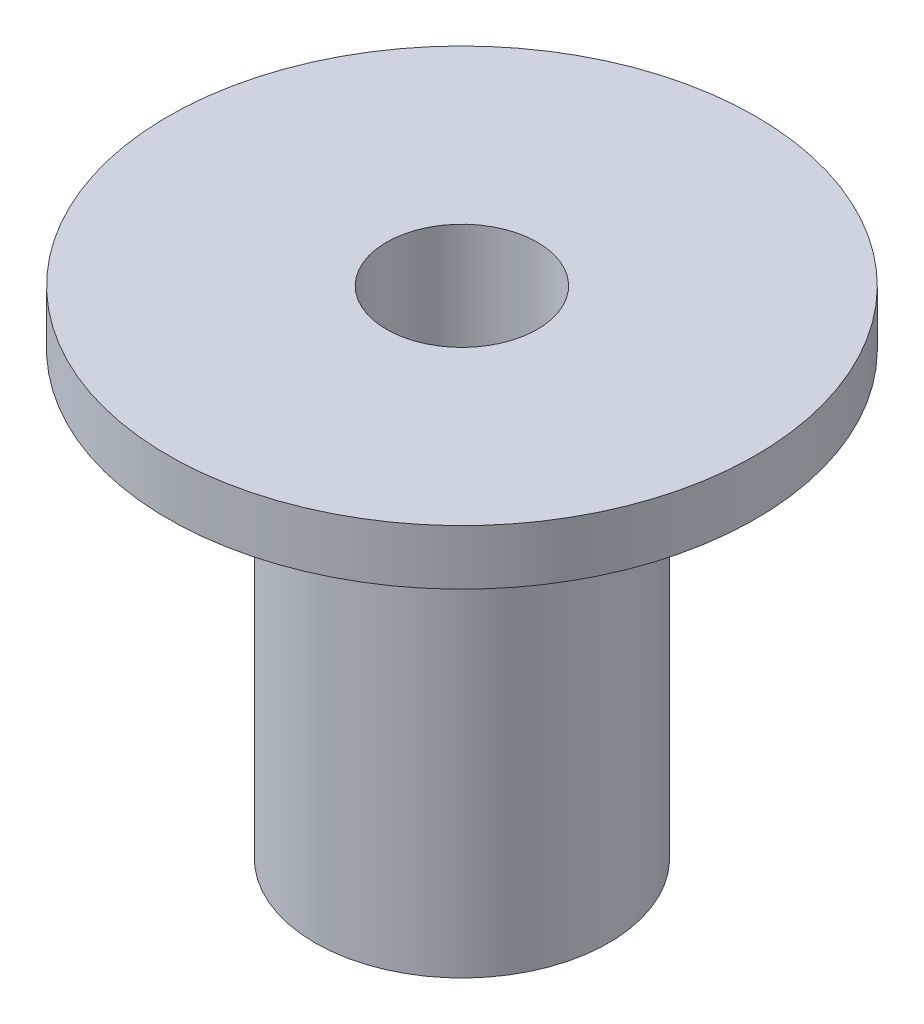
ISO-10303-21;
HEADER;
FILE_DESCRIPTION(('STEP AP214'),'2;1');
FILE_NAME('part.step','',(''),(''),'','','');
FILE_SCHEMA(('AUTOMOTIVE_DESIGN { 1 0 10303 214 1 1 1 1 }'));
ENDSEC;
DATA;
#1=APPLICATION_CONTEXT('core data for automotive mechanical design processes');
#2=APPLICATION_PROTOCOL_DEFINITION('international standard','automotive_design',2000,#1);
#3=PRODUCT_CONTEXT('',#1,'mechanical');
#4=PRODUCT('Part','Part','',(#3));
#5=PRODUCT_RELATED_PRODUCT_CATEGORY('part','',(#4));
#6=PRODUCT_DEFINITION_FORMATION('','',#4);
#7=PRODUCT_DEFINITION_CONTEXT('part definition',#1,'design');
#8=PRODUCT_DEFINITION('design','',#6,#7);
#9=PRODUCT_DEFINITION_SHAPE('','',#8);
#10=(LENGTH_UNIT() NAMED_UNIT(*) SI_UNIT(.MILLI.,.METRE.));
#11=(NAMED_UNIT(*) PLANE_ANGLE_UNIT() SI_UNIT($,.RADIAN.));
#12=(NAMED_UNIT(*) SI_UNIT($,.STERADIAN.) SOLID_ANGLE_UNIT());
#13=UNCERTAINTY_MEASURE_WITH_UNIT(LENGTH_MEASURE(1.E-05),#10,'distance_accuracy_value','');
#14=(GEOMETRIC_REPRESENTATION_CONTEXT(3) GLOBAL_UNCERTAINTY_ASSIGNED_CONTEXT((#13)) GLOBAL_UNIT_ASSIGNED_CONTEXT((#10,
#11,#12)) REPRESENTATION_CONTEXT('',''));
#15=CARTESIAN_POINT('',(0.,0.,0.));
#16=DIRECTION('',(0.,0.,1.));
#17=DIRECTION('',(1.,0.,0.));
#18=AXIS2_PLACEMENT_3D('',#15,#16,#17);
#19=CARTESIAN_POINT('',(6.35,0.,0.));
#20=DIRECTION('',(0.,-1.,0.));
#21=DIRECTION('',(0.,0.,-1.));
#22=AXIS2_PLACEMENT_3D('',#19,#20,#21);
#23=PLANE('',#22);
#24=CARTESIAN_POINT('',(0.,0.,0.));
#25=DIRECTION('',(0.,-1.,0.));
#26=DIRECTION('',(0.,0.,-1.));
#27=AXIS2_PLACEMENT_3D('',#24,#25,#26);
#28=CIRCLE('',#27,6.35);
#29=CARTESIAN_POINT('',(0.,0.,-6.35));
#30=VERTEX_POINT('',#29);
#31=EDGE_CURVE('E62',#30,#30,#28,.T.);
#32=ORIENTED_EDGE('',*,*,#31,.T.);
#33=EDGE_LOOP('',(#32));
#34=FACE_BOUND('',#33,.T.);
#35=CARTESIAN_POINT('',(0.,0.,0.));
#36=DIRECTION('',(0.,-1.,0.));
#37=DIRECTION('',(0.,0.,-1.));
#38=AXIS2_PLACEMENT_3D('',#35,#36,#37);
#39=CIRCLE('',#38,3.2639);
#40=CARTESIAN_POINT('',(0.,0.,-3.2639));
#41=VERTEX_POINT('',#40);
#42=EDGE_CURVE('E10',#41,#41,#39,.T.);
#43=ORIENTED_EDGE('',*,*,#42,.F.);
#44=EDGE_LOOP('',(#43));
#45=FACE_BOUND('',#44,.T.);
#46=ADVANCED_FACE('F34',(#34,#45),#23,.T.);
#47=CARTESIAN_POINT('',(0.,0.,0.));
#48=DIRECTION('',(0.,-1.,0.));
#49=DIRECTION('',(0.,0.,-1.));
#50=AXIS2_PLACEMENT_3D('',#47,#48,#49);
#51=CYLINDRICAL_SURFACE('',#50,3.2639);
#52=ORIENTED_EDGE('',*,*,#42,.T.);
#53=EDGE_LOOP('',(#52));
#54=FACE_BOUND('',#53,.T.);
#55=CARTESIAN_POINT('',(0.,21.43125,0.));
#56=DIRECTION('',(0.,-1.,0.));
#57=DIRECTION('',(0.,0.,-1.));
#58=AXIS2_PLACEMENT_3D('',#55,#56,#57);
#59=CIRCLE('',#58,3.2639);
#60=CARTESIAN_POINT('',(0.,21.43125,-3.2639));
#61=VERTEX_POINT('',#60);
#62=EDGE_CURVE('E41',#61,#61,#59,.T.);
#63=ORIENTED_EDGE('',*,*,#62,.F.);
#64=EDGE_LOOP('',(#63));
#65=FACE_BOUND('',#64,.T.);
#66=ADVANCED_FACE('F80',(#54,#65),#51,.F.);
#67=CARTESIAN_POINT('',(3.2639,21.43125,0.));
#68=DIRECTION('',(0.,1.,0.));
#69=DIRECTION('',(0.,0.,1.));
#70=AXIS2_PLACEMENT_3D('',#67,#68,#69);
#71=PLANE('',#70);
#72=ORIENTED_EDGE('',*,*,#62,.T.);
#73=EDGE_LOOP('',(#72));
#74=FACE_BOUND('',#73,.T.);
#75=CARTESIAN_POINT('',(0.,21.43125,0.));
#76=DIRECTION('',(0.,-1.,0.));
#77=DIRECTION('',(0.,0.,-1.));
#78=AXIS2_PLACEMENT_3D('',#75,#76,#77);
#79=CIRCLE('',#78,12.7);
#80=CARTESIAN_POINT('',(0.,21.43125,-12.7));
#81=VERTEX_POINT('',#80);
#82=EDGE_CURVE('E48',#81,#81,#79,.T.);
#83=ORIENTED_EDGE('',*,*,#82,.F.);
#84=EDGE_LOOP('',(#83));
#85=FACE_BOUND('',#84,.T.);
#86=ADVANCED_FACE('F84',(#74,#85),#71,.T.);
#87=CARTESIAN_POINT('',(0.,0.,0.));
#88=DIRECTION('',(0.,-1.,0.));
#89=DIRECTION('',(0.,0.,-1.));
#90=AXIS2_PLACEMENT_3D('',#87,#88,#89);
#91=CYLINDRICAL_SURFACE('',#90,12.7);
#92=ORIENTED_EDGE('',*,*,#82,.T.);
#93=EDGE_LOOP('',(#92));
#94=FACE_BOUND('',#93,.T.);
#95=CARTESIAN_POINT('',(0.,19.05,0.));
#96=DIRECTION('',(0.,-1.,0.));
#97=DIRECTION('',(0.,0.,-1.));
#98=AXIS2_PLACEMENT_3D('',#95,#96,#97);
#99=CIRCLE('',#98,12.7);
#100=CARTESIAN_POINT('',(0.,19.05,-12.7));
#101=VERTEX_POINT('',#100);
#102=EDGE_CURVE('E53',#101,#101,#99,.T.);
#103=ORIENTED_EDGE('',*,*,#102,.F.);
#104=EDGE_LOOP('',(#103));
#105=FACE_BOUND('',#104,.T.);
#106=ADVANCED_FACE('F76',(#94,#105),#91,.T.);
#107=CARTESIAN_POINT('',(12.7,19.05,0.));
#108=DIRECTION('',(0.,-1.,0.));
#109=DIRECTION('',(0.,0.,-1.));
#110=AXIS2_PLACEMENT_3D('',#107,#108,#109);
#111=PLANE('',#110);
#112=ORIENTED_EDGE('',*,*,#102,.T.);
#113=EDGE_LOOP('',(#112));
#114=FACE_BOUND('',#113,.T.);
#115=CARTESIAN_POINT('',(0.,19.05,0.));
#116=DIRECTION('',(0.,-1.,0.));
#117=DIRECTION('',(0.,0.,-1.));
#118=AXIS2_PLACEMENT_3D('',#115,#116,#117);
#119=CIRCLE('',#118,6.35);
#120=CARTESIAN_POINT('',(0.,19.05,-6.35));
#121=VERTEX_POINT('',#120);
#122=EDGE_CURVE('E58',#121,#121,#119,.T.);
#123=ORIENTED_EDGE('',*,*,#122,.F.);
#124=EDGE_LOOP('',(#123));
#125=FACE_BOUND('',#124,.T.);
#126=ADVANCED_FACE('F70',(#114,#125),#111,.T.);
#127=CARTESIAN_POINT('',(0.,0.,0.));
#128=DIRECTION('',(0.,-1.,0.));
#129=DIRECTION('',(0.,0.,-1.));
#130=AXIS2_PLACEMENT_3D('',#127,#128,#129);
#131=CYLINDRICAL_SURFACE('',#130,6.35);
#132=ORIENTED_EDGE('',*,*,#122,.T.);
#133=EDGE_LOOP('',(#132));
#134=FACE_BOUND('',#133,.T.);
#135=ORIENTED_EDGE('',*,*,#31,.F.);
#136=EDGE_LOOP('',(#135));
#137=FACE_BOUND('',#136,.T.);
#138=ADVANCED_FACE('F68',(#134,#137),#131,.T.);
#139=CLOSED_SHELL('',(#46,#66,#86,#106,#126,#138));
#140=MANIFOLD_SOLID_BREP('B2',#139);
#141=ADVANCED_BREP_SHAPE_REPRESENTATION('',(#18,#140),#14);
#142=SHAPE_DEFINITION_REPRESENTATION(#9,#141);
ENDSEC;
END-ISO-10303-21;
